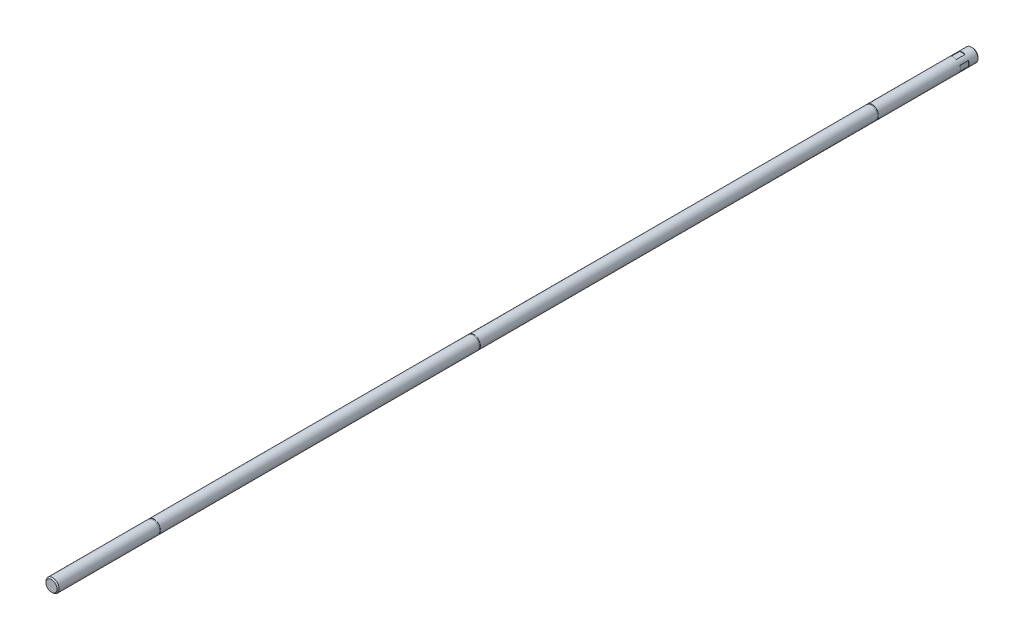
ISO-10303-21;
HEADER;
FILE_DESCRIPTION(('STEP AP214'),'2;1');
FILE_NAME('part.step','',(''),(''),'','','');
FILE_SCHEMA(('AUTOMOTIVE_DESIGN { 1 0 10303 214 1 1 1 1 }'));
ENDSEC;
DATA;
#1=APPLICATION_CONTEXT('core data for automotive mechanical design processes');
#2=APPLICATION_PROTOCOL_DEFINITION('international standard','automotive_design',2000,#1);
#3=PRODUCT_CONTEXT('',#1,'mechanical');
#4=PRODUCT('Part','Part','',(#3));
#5=PRODUCT_RELATED_PRODUCT_CATEGORY('part','',(#4));
#6=PRODUCT_DEFINITION_FORMATION('','',#4);
#7=PRODUCT_DEFINITION_CONTEXT('part definition',#1,'design');
#8=PRODUCT_DEFINITION('design','',#6,#7);
#9=PRODUCT_DEFINITION_SHAPE('','',#8);
#10=(LENGTH_UNIT() NAMED_UNIT(*) SI_UNIT(.MILLI.,.METRE.));
#11=(NAMED_UNIT(*) PLANE_ANGLE_UNIT() SI_UNIT($,.RADIAN.));
#12=(NAMED_UNIT(*) SI_UNIT($,.STERADIAN.) SOLID_ANGLE_UNIT());
#13=UNCERTAINTY_MEASURE_WITH_UNIT(LENGTH_MEASURE(1.E-05),#10,'distance_accuracy_value','');
#14=(GEOMETRIC_REPRESENTATION_CONTEXT(3) GLOBAL_UNCERTAINTY_ASSIGNED_CONTEXT((#13)) GLOBAL_UNIT_ASSIGNED_CONTEXT((#10,
#11,#12)) REPRESENTATION_CONTEXT('',''));
#15=CARTESIAN_POINT('',(0.,0.,0.));
#16=DIRECTION('',(0.,0.,1.));
#17=DIRECTION('',(1.,0.,0.));
#18=AXIS2_PLACEMENT_3D('',#15,#16,#17);
#19=CARTESIAN_POINT('',(0.,0.,835.));
#20=DIRECTION('',(0.,0.,-1.));
#21=DIRECTION('',(-1.,0.,0.));
#22=AXIS2_PLACEMENT_3D('',#19,#20,#21);
#23=CYLINDRICAL_SURFACE('',#22,6.);
#24=CARTESIAN_POINT('',(0.,0.,834.));
#25=DIRECTION('',(0.,0.,1.));
#26=DIRECTION('',(1.,0.,0.));
#27=AXIS2_PLACEMENT_3D('',#24,#25,#26);
#28=CIRCLE('',#27,6.);
#29=CARTESIAN_POINT('',(6.,0.,834.));
#30=VERTEX_POINT('',#29);
#31=EDGE_CURVE('E12',#30,#30,#28,.F.);
#32=ORIENTED_EDGE('',*,*,#31,.T.);
#33=EDGE_LOOP('',(#32));
#34=FACE_BOUND('',#33,.T.);
#35=CARTESIAN_POINT('',(0.,0.,743.2));
#36=DIRECTION('',(0.,0.,1.));
#37=DIRECTION('',(1.,0.,0.));
#38=AXIS2_PLACEMENT_3D('',#35,#36,#37);
#39=CIRCLE('',#38,6.);
#40=CARTESIAN_POINT('',(6.,0.,743.2));
#41=VERTEX_POINT('',#40);
#42=EDGE_CURVE('E974',#41,#41,#39,.T.);
#43=ORIENTED_EDGE('',*,*,#42,.T.);
#44=EDGE_LOOP('',(#43));
#45=FACE_BOUND('',#44,.T.);
#46=ADVANCED_FACE('F770',(#34,#45),#23,.T.);
#47=CARTESIAN_POINT('',(0.,0.,835.));
#48=DIRECTION('',(0.,0.,1.));
#49=DIRECTION('',(1.,0.,0.));
#50=AXIS2_PLACEMENT_3D('',#47,#48,#49);
#51=PLANE('',#50);
#52=CARTESIAN_POINT('',(0.,0.,835.));
#53=DIRECTION('',(0.,0.,1.));
#54=DIRECTION('',(1.,0.,0.));
#55=AXIS2_PLACEMENT_3D('',#52,#53,#54);
#56=CIRCLE('',#55,5.00000000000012);
#57=CARTESIAN_POINT('',(5.00000000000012,0.,835.));
#58=VERTEX_POINT('',#57);
#59=EDGE_CURVE('E779',#58,#58,#56,.T.);
#60=ORIENTED_EDGE('',*,*,#59,.T.);
#61=EDGE_LOOP('',(#60));
#62=FACE_BOUND('',#61,.T.);
#63=ADVANCED_FACE('F876',(#62),#51,.T.);
#64=CARTESIAN_POINT('',(6.,0.,743.2));
#65=DIRECTION('',(0.,0.,1.));
#66=DIRECTION('',(1.,0.,0.));
#67=AXIS2_PLACEMENT_3D('',#64,#65,#66);
#68=PLANE('',#67);
#69=ORIENTED_EDGE('',*,*,#42,.F.);
#70=EDGE_LOOP('',(#69));
#71=FACE_BOUND('',#70,.T.);
#72=CARTESIAN_POINT('',(0.,0.,743.2));
#73=DIRECTION('',(0.,0.,1.));
#74=DIRECTION('',(1.,0.,0.));
#75=AXIS2_PLACEMENT_3D('',#72,#73,#74);
#76=CIRCLE('',#75,5.74999999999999);
#77=CARTESIAN_POINT('',(5.74999999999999,0.,743.2));
#78=VERTEX_POINT('',#77);
#79=EDGE_CURVE('E1313',#78,#78,#76,.T.);
#80=ORIENTED_EDGE('',*,*,#79,.T.);
#81=EDGE_LOOP('',(#80));
#82=FACE_BOUND('',#81,.T.);
#83=ADVANCED_FACE('F893',(#71,#82),#68,.F.);
#84=CARTESIAN_POINT('',(0.,0.,835.));
#85=DIRECTION('',(0.,0.,1.));
#86=DIRECTION('',(1.,0.,0.));
#87=AXIS2_PLACEMENT_3D('',#84,#85,#86);
#88=CYLINDRICAL_SURFACE('',#87,5.74999999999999);
#89=ORIENTED_EDGE('',*,*,#79,.F.);
#90=EDGE_LOOP('',(#89));
#91=FACE_BOUND('',#90,.T.);
#92=CARTESIAN_POINT('',(0.,0.,742.1));
#93=DIRECTION('',(0.,0.,1.));
#94=DIRECTION('',(1.,0.,0.));
#95=AXIS2_PLACEMENT_3D('',#92,#93,#94);
#96=CIRCLE('',#95,5.74999999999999);
#97=CARTESIAN_POINT('',(5.74999999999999,0.,742.1));
#98=VERTEX_POINT('',#97);
#99=EDGE_CURVE('E1315',#98,#98,#96,.T.);
#100=ORIENTED_EDGE('',*,*,#99,.T.);
#101=EDGE_LOOP('',(#100));
#102=FACE_BOUND('',#101,.T.);
#103=ADVANCED_FACE('F923',(#91,#102),#88,.T.);
#104=CARTESIAN_POINT('',(6.,0.,742.1));
#105=DIRECTION('',(0.,0.,-1.));
#106=DIRECTION('',(-1.,0.,0.));
#107=AXIS2_PLACEMENT_3D('',#104,#105,#106);
#108=PLANE('',#107);
#109=ORIENTED_EDGE('',*,*,#99,.F.);
#110=EDGE_LOOP('',(#109));
#111=FACE_BOUND('',#110,.T.);
#112=CARTESIAN_POINT('',(0.,0.,742.1));
#113=DIRECTION('',(0.,0.,1.));
#114=DIRECTION('',(1.,0.,0.));
#115=AXIS2_PLACEMENT_3D('',#112,#113,#114);
#116=CIRCLE('',#115,6.);
#117=CARTESIAN_POINT('',(6.,0.,742.1));
#118=VERTEX_POINT('',#117);
#119=EDGE_CURVE('E929',#118,#118,#116,.T.);
#120=ORIENTED_EDGE('',*,*,#119,.T.);
#121=EDGE_LOOP('',(#120));
#122=FACE_BOUND('',#121,.T.);
#123=ADVANCED_FACE('F914',(#111,#122),#108,.F.);
#124=ORIENTED_EDGE('',*,*,#119,.F.);
#125=EDGE_LOOP('',(#124));
#126=FACE_BOUND('',#125,.T.);
#127=CARTESIAN_POINT('',(0.,0.,453.2));
#128=DIRECTION('',(0.,0.,1.));
#129=DIRECTION('',(1.,0.,0.));
#130=AXIS2_PLACEMENT_3D('',#127,#128,#129);
#131=CIRCLE('',#130,6.);
#132=CARTESIAN_POINT('',(6.,0.,453.2));
#133=VERTEX_POINT('',#132);
#134=EDGE_CURVE('E932',#133,#133,#131,.T.);
#135=ORIENTED_EDGE('',*,*,#134,.T.);
#136=EDGE_LOOP('',(#135));
#137=FACE_BOUND('',#136,.T.);
#138=ADVANCED_FACE('F901',(#126,#137),#23,.T.);
#139=CARTESIAN_POINT('',(6.,0.,453.2));
#140=DIRECTION('',(0.,0.,1.));
#141=DIRECTION('',(1.,0.,0.));
#142=AXIS2_PLACEMENT_3D('',#139,#140,#141);
#143=PLANE('',#142);
#144=ORIENTED_EDGE('',*,*,#134,.F.);
#145=EDGE_LOOP('',(#144));
#146=FACE_BOUND('',#145,.T.);
#147=CARTESIAN_POINT('',(0.,0.,453.2));
#148=DIRECTION('',(0.,0.,1.));
#149=DIRECTION('',(1.,0.,0.));
#150=AXIS2_PLACEMENT_3D('',#147,#148,#149);
#151=CIRCLE('',#150,5.74999999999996);
#152=CARTESIAN_POINT('',(5.74999999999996,0.,453.2));
#153=VERTEX_POINT('',#152);
#154=EDGE_CURVE('E935',#153,#153,#151,.T.);
#155=ORIENTED_EDGE('',*,*,#154,.T.);
#156=EDGE_LOOP('',(#155));
#157=FACE_BOUND('',#156,.T.);
#158=ADVANCED_FACE('F913',(#146,#157),#143,.F.);
#159=CARTESIAN_POINT('',(0.,0.,835.));
#160=DIRECTION('',(0.,0.,1.));
#161=DIRECTION('',(1.,0.,0.));
#162=AXIS2_PLACEMENT_3D('',#159,#160,#161);
#163=CYLINDRICAL_SURFACE('',#162,5.74999999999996);
#164=ORIENTED_EDGE('',*,*,#154,.F.);
#165=EDGE_LOOP('',(#164));
#166=FACE_BOUND('',#165,.T.);
#167=CARTESIAN_POINT('',(0.,0.,452.1));
#168=DIRECTION('',(0.,0.,1.));
#169=DIRECTION('',(1.,0.,0.));
#170=AXIS2_PLACEMENT_3D('',#167,#168,#169);
#171=CIRCLE('',#170,5.74999999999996);
#172=CARTESIAN_POINT('',(5.74999999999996,0.,452.1));
#173=VERTEX_POINT('',#172);
#174=EDGE_CURVE('E944',#173,#173,#171,.T.);
#175=ORIENTED_EDGE('',*,*,#174,.T.);
#176=EDGE_LOOP('',(#175));
#177=FACE_BOUND('',#176,.T.);
#178=ADVANCED_FACE('F920',(#166,#177),#163,.T.);
#179=CARTESIAN_POINT('',(6.,0.,452.1));
#180=DIRECTION('',(0.,0.,-1.));
#181=DIRECTION('',(-1.,0.,0.));
#182=AXIS2_PLACEMENT_3D('',#179,#180,#181);
#183=PLANE('',#182);
#184=ORIENTED_EDGE('',*,*,#174,.F.);
#185=EDGE_LOOP('',(#184));
#186=FACE_BOUND('',#185,.T.);
#187=CARTESIAN_POINT('',(0.,0.,452.1));
#188=DIRECTION('',(0.,0.,1.));
#189=DIRECTION('',(1.,0.,0.));
#190=AXIS2_PLACEMENT_3D('',#187,#188,#189);
#191=CIRCLE('',#190,6.);
#192=CARTESIAN_POINT('',(6.,0.,452.1));
#193=VERTEX_POINT('',#192);
#194=EDGE_CURVE('E1336',#193,#193,#191,.T.);
#195=ORIENTED_EDGE('',*,*,#194,.T.);
#196=EDGE_LOOP('',(#195));
#197=FACE_BOUND('',#196,.T.);
#198=ADVANCED_FACE('F899',(#186,#197),#183,.F.);
#199=CARTESIAN_POINT('',(0.,0.,92.1));
#200=DIRECTION('',(0.,0.,1.));
#201=DIRECTION('',(1.,0.,0.));
#202=AXIS2_PLACEMENT_3D('',#199,#200,#201);
#203=CIRCLE('',#202,6.);
#204=CARTESIAN_POINT('',(6.,0.,92.1));
#205=VERTEX_POINT('',#204);
#206=EDGE_CURVE('E1332',#205,#205,#203,.T.);
#207=ORIENTED_EDGE('',*,*,#206,.T.);
#208=EDGE_LOOP('',(#207));
#209=FACE_BOUND('',#208,.T.);
#210=ORIENTED_EDGE('',*,*,#194,.F.);
#211=EDGE_LOOP('',(#210));
#212=FACE_BOUND('',#211,.T.);
#213=ADVANCED_FACE('F889',(#209,#212),#23,.T.);
#214=CARTESIAN_POINT('',(6.,0.,92.1));
#215=DIRECTION('',(0.,0.,1.));
#216=DIRECTION('',(1.,0.,0.));
#217=AXIS2_PLACEMENT_3D('',#214,#215,#216);
#218=PLANE('',#217);
#219=ORIENTED_EDGE('',*,*,#206,.F.);
#220=EDGE_LOOP('',(#219));
#221=FACE_BOUND('',#220,.T.);
#222=CARTESIAN_POINT('',(0.,0.,92.1));
#223=DIRECTION('',(0.,0.,1.));
#224=DIRECTION('',(1.,0.,0.));
#225=AXIS2_PLACEMENT_3D('',#222,#223,#224);
#226=CIRCLE('',#225,5.74999999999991);
#227=CARTESIAN_POINT('',(5.74999999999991,0.,92.1));
#228=VERTEX_POINT('',#227);
#229=EDGE_CURVE('E1328',#228,#228,#226,.T.);
#230=ORIENTED_EDGE('',*,*,#229,.T.);
#231=EDGE_LOOP('',(#230));
#232=FACE_BOUND('',#231,.T.);
#233=ADVANCED_FACE('F898',(#221,#232),#218,.F.);
#234=CARTESIAN_POINT('',(0.,0.,835.));
#235=DIRECTION('',(0.,0.,1.));
#236=DIRECTION('',(1.,0.,0.));
#237=AXIS2_PLACEMENT_3D('',#234,#235,#236);
#238=CYLINDRICAL_SURFACE('',#237,5.74999999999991);
#239=ORIENTED_EDGE('',*,*,#229,.F.);
#240=EDGE_LOOP('',(#239));
#241=FACE_BOUND('',#240,.T.);
#242=CARTESIAN_POINT('',(0.,0.,91.));
#243=DIRECTION('',(0.,0.,1.));
#244=DIRECTION('',(1.,0.,0.));
#245=AXIS2_PLACEMENT_3D('',#242,#243,#244);
#246=CIRCLE('',#245,5.74999999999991);
#247=CARTESIAN_POINT('',(5.74999999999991,0.,91.));
#248=VERTEX_POINT('',#247);
#249=EDGE_CURVE('E941',#248,#248,#246,.T.);
#250=ORIENTED_EDGE('',*,*,#249,.T.);
#251=EDGE_LOOP('',(#250));
#252=FACE_BOUND('',#251,.T.);
#253=ADVANCED_FACE('F1120',(#241,#252),#238,.T.);
#254=CARTESIAN_POINT('',(6.,0.,91.));
#255=DIRECTION('',(0.,0.,-1.));
#256=DIRECTION('',(-1.,0.,0.));
#257=AXIS2_PLACEMENT_3D('',#254,#255,#256);
#258=PLANE('',#257);
#259=ORIENTED_EDGE('',*,*,#249,.F.);
#260=EDGE_LOOP('',(#259));
#261=FACE_BOUND('',#260,.T.);
#262=CARTESIAN_POINT('',(0.,0.,91.));
#263=DIRECTION('',(0.,0.,1.));
#264=DIRECTION('',(1.,0.,0.));
#265=AXIS2_PLACEMENT_3D('',#262,#263,#264);
#266=CIRCLE('',#265,6.);
#267=CARTESIAN_POINT('',(6.,0.,91.));
#268=VERTEX_POINT('',#267);
#269=EDGE_CURVE('E934',#268,#268,#266,.T.);
#270=ORIENTED_EDGE('',*,*,#269,.T.);
#271=EDGE_LOOP('',(#270));
#272=FACE_BOUND('',#271,.T.);
#273=ADVANCED_FACE('F1113',(#261,#272),#258,.F.);
#274=CARTESIAN_POINT('',(0.,0.,9.));
#275=DIRECTION('',(0.,0.,-1.));
#276=DIRECTION('',(0.,-1.,0.));
#277=AXIS2_PLACEMENT_3D('',#274,#275,#276);
#278=PLANE('',#277);
#279=DIRECTION('',(0.,1.,0.));
#280=VECTOR('',#279,1.);
#281=CARTESIAN_POINT('',(-5.49999999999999,-2.39791576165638,9.));
#282=LINE('',#281,#280);
#283=CARTESIAN_POINT('',(-5.49999999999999,-2.39791576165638,9.));
#284=VERTEX_POINT('',#283);
#285=CARTESIAN_POINT('',(-5.50000000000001,2.39791576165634,9.00000000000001));
#286=VERTEX_POINT('',#285);
#287=EDGE_CURVE('E844',#284,#286,#282,.T.);
#288=ORIENTED_EDGE('',*,*,#287,.T.);
#289=CARTESIAN_POINT('',(0.,0.,9.00000000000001));
#290=DIRECTION('',(0.,0.,-1.));
#291=DIRECTION('',(-1.,0.,0.));
#292=AXIS2_PLACEMENT_3D('',#289,#290,#291);
#293=CIRCLE('',#292,6.);
#294=EDGE_CURVE('E857',#284,#286,#293,.T.);
#295=ORIENTED_EDGE('',*,*,#294,.F.);
#296=EDGE_LOOP('',(#288,#295));
#297=FACE_BOUND('',#296,.T.);
#298=ADVANCED_FACE('F1119',(#297),#278,.F.);
#299=CARTESIAN_POINT('',(-5.49999999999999,-2.39791576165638,17.));
#300=DIRECTION('',(-1.,0.,0.));
#301=DIRECTION('',(0.,-1.,0.));
#302=AXIS2_PLACEMENT_3D('',#299,#300,#301);
#303=PLANE('',#302);
#304=ORIENTED_EDGE('',*,*,#287,.F.);
#305=DIRECTION('',(0.,0.,-1.));
#306=VECTOR('',#305,1.);
#307=CARTESIAN_POINT('',(-5.49999999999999,-2.39791576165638,17.));
#308=LINE('',#307,#306);
#309=CARTESIAN_POINT('',(-5.49999999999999,-2.39791576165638,17.));
#310=VERTEX_POINT('',#309);
#311=EDGE_CURVE('E847',#310,#284,#308,.T.);
#312=ORIENTED_EDGE('',*,*,#311,.F.);
#313=DIRECTION('',(0.,1.,0.));
#314=VECTOR('',#313,1.);
#315=CARTESIAN_POINT('',(-5.49999999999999,-2.39791576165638,17.));
#316=LINE('',#315,#314);
#317=CARTESIAN_POINT('',(-5.50000000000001,2.39791576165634,17.));
#318=VERTEX_POINT('',#317);
#319=EDGE_CURVE('E838',#310,#318,#316,.T.);
#320=ORIENTED_EDGE('',*,*,#319,.T.);
#321=DIRECTION('',(0.,0.,-1.));
#322=VECTOR('',#321,1.);
#323=CARTESIAN_POINT('',(-5.50000000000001,2.39791576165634,17.));
#324=LINE('',#323,#322);
#325=EDGE_CURVE('E786',#318,#286,#324,.T.);
#326=ORIENTED_EDGE('',*,*,#325,.T.);
#327=EDGE_LOOP('',(#304,#312,#320,#326));
#328=FACE_BOUND('',#327,.T.);
#329=ADVANCED_FACE('F848',(#328),#303,.T.);
#330=CARTESIAN_POINT('',(0.,0.,17.));
#331=DIRECTION('',(0.,0.,-1.));
#332=DIRECTION('',(0.,-1.,0.));
#333=AXIS2_PLACEMENT_3D('',#330,#331,#332);
#334=PLANE('',#333);
#335=CARTESIAN_POINT('',(0.,0.,17.));
#336=DIRECTION('',(0.,0.,-1.));
#337=DIRECTION('',(-1.,0.,0.));
#338=AXIS2_PLACEMENT_3D('',#335,#336,#337);
#339=CIRCLE('',#338,6.);
#340=EDGE_CURVE('E842',#310,#318,#339,.T.);
#341=ORIENTED_EDGE('',*,*,#340,.T.);
#342=ORIENTED_EDGE('',*,*,#319,.F.);
#343=EDGE_LOOP('',(#341,#342));
#344=FACE_BOUND('',#343,.T.);
#345=ADVANCED_FACE('F840',(#344),#334,.T.);
#346=CARTESIAN_POINT('',(0.,0.,9.));
#347=DIRECTION('',(0.,0.,-1.));
#348=DIRECTION('',(0.,1.,0.));
#349=AXIS2_PLACEMENT_3D('',#346,#347,#348);
#350=PLANE('',#349);
#351=DIRECTION('',(0.,-1.,0.));
#352=VECTOR('',#351,1.);
#353=CARTESIAN_POINT('',(5.49999999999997,2.39791576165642,9.));
#354=LINE('',#353,#352);
#355=CARTESIAN_POINT('',(5.49999999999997,2.39791576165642,9.));
#356=VERTEX_POINT('',#355);
#357=CARTESIAN_POINT('',(5.50000000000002,-2.39791576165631,9.00000000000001));
#358=VERTEX_POINT('',#357);
#359=EDGE_CURVE('E970',#356,#358,#354,.T.);
#360=ORIENTED_EDGE('',*,*,#359,.T.);
#361=CARTESIAN_POINT('',(0.,0.,9.00000000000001));
#362=DIRECTION('',(0.,0.,-1.));
#363=DIRECTION('',(-1.,0.,0.));
#364=AXIS2_PLACEMENT_3D('',#361,#362,#363);
#365=CIRCLE('',#364,6.);
#366=EDGE_CURVE('E1001',#356,#358,#365,.T.);
#367=ORIENTED_EDGE('',*,*,#366,.F.);
#368=EDGE_LOOP('',(#360,#367));
#369=FACE_BOUND('',#368,.T.);
#370=ADVANCED_FACE('F1038',(#369),#350,.F.);
#371=CARTESIAN_POINT('',(5.49999999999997,2.39791576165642,17.));
#372=DIRECTION('',(1.,0.,0.));
#373=DIRECTION('',(0.,1.,0.));
#374=AXIS2_PLACEMENT_3D('',#371,#372,#373);
#375=PLANE('',#374);
#376=ORIENTED_EDGE('',*,*,#359,.F.);
#377=DIRECTION('',(0.,0.,-1.));
#378=VECTOR('',#377,1.);
#379=CARTESIAN_POINT('',(5.49999999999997,2.39791576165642,17.));
#380=LINE('',#379,#378);
#381=CARTESIAN_POINT('',(5.49999999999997,2.39791576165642,17.));
#382=VERTEX_POINT('',#381);
#383=EDGE_CURVE('E959',#382,#356,#380,.T.);
#384=ORIENTED_EDGE('',*,*,#383,.F.);
#385=DIRECTION('',(0.,-1.,0.));
#386=VECTOR('',#385,1.);
#387=CARTESIAN_POINT('',(5.49999999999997,2.39791576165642,17.));
#388=LINE('',#387,#386);
#389=CARTESIAN_POINT('',(5.50000000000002,-2.39791576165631,17.));
#390=VERTEX_POINT('',#389);
#391=EDGE_CURVE('E965',#382,#390,#388,.T.);
#392=ORIENTED_EDGE('',*,*,#391,.T.);
#393=DIRECTION('',(0.,0.,-1.));
#394=VECTOR('',#393,1.);
#395=CARTESIAN_POINT('',(5.50000000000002,-2.39791576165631,17.));
#396=LINE('',#395,#394);
#397=EDGE_CURVE('E969',#390,#358,#396,.T.);
#398=ORIENTED_EDGE('',*,*,#397,.T.);
#399=EDGE_LOOP('',(#376,#384,#392,#398));
#400=FACE_BOUND('',#399,.T.);
#401=ADVANCED_FACE('F1036',(#400),#375,.T.);
#402=CARTESIAN_POINT('',(0.,0.,17.));
#403=DIRECTION('',(0.,0.,-1.));
#404=DIRECTION('',(0.,1.,0.));
#405=AXIS2_PLACEMENT_3D('',#402,#403,#404);
#406=PLANE('',#405);
#407=CARTESIAN_POINT('',(0.,0.,17.));
#408=DIRECTION('',(0.,0.,-1.));
#409=DIRECTION('',(-1.,0.,0.));
#410=AXIS2_PLACEMENT_3D('',#407,#408,#409);
#411=CIRCLE('',#410,6.);
#412=EDGE_CURVE('E1005',#382,#390,#411,.T.);
#413=ORIENTED_EDGE('',*,*,#412,.T.);
#414=ORIENTED_EDGE('',*,*,#391,.F.);
#415=EDGE_LOOP('',(#413,#414));
#416=FACE_BOUND('',#415,.T.);
#417=ADVANCED_FACE('F1032',(#416),#406,.T.);
#418=CARTESIAN_POINT('',(0.,0.,0.));
#419=DIRECTION('',(0.,0.,1.));
#420=DIRECTION('',(1.,0.,0.));
#421=AXIS2_PLACEMENT_3D('',#418,#419,#420);
#422=PLANE('',#421);
#423=CARTESIAN_POINT('',(0.,0.,0.));
#424=DIRECTION('',(0.,0.,1.));
#425=DIRECTION('',(1.,0.,0.));
#426=AXIS2_PLACEMENT_3D('',#423,#424,#425);
#427=CIRCLE('',#426,5.00000000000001);
#428=CARTESIAN_POINT('',(5.00000000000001,0.,0.));
#429=VERTEX_POINT('',#428);
#430=EDGE_CURVE('E863',#429,#429,#427,.F.);
#431=ORIENTED_EDGE('',*,*,#430,.T.);
#432=EDGE_LOOP('',(#431));
#433=FACE_BOUND('',#432,.T.);
#434=ADVANCED_FACE('F1035',(#433),#422,.F.);
#435=CARTESIAN_POINT('',(0.,0.,9.));
#436=DIRECTION('',(0.,0.,-1.));
#437=DIRECTION('',(-1.,0.,0.));
#438=AXIS2_PLACEMENT_3D('',#435,#436,#437);
#439=PLANE('',#438);
#440=DIRECTION('',(1.,0.,0.));
#441=VECTOR('',#440,1.);
#442=CARTESIAN_POINT('',(-2.39791576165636,5.5,9.));
#443=LINE('',#442,#441);
#444=CARTESIAN_POINT('',(-2.39791576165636,5.5,9.));
#445=VERTEX_POINT('',#444);
#446=CARTESIAN_POINT('',(2.39791576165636,5.5,9.00000000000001));
#447=VERTEX_POINT('',#446);
#448=EDGE_CURVE('E852',#445,#447,#443,.T.);
#449=ORIENTED_EDGE('',*,*,#448,.T.);
#450=CARTESIAN_POINT('',(0.,0.,9.00000000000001));
#451=DIRECTION('',(0.,0.,-1.));
#452=DIRECTION('',(-1.,0.,0.));
#453=AXIS2_PLACEMENT_3D('',#450,#451,#452);
#454=CIRCLE('',#453,6.);
#455=EDGE_CURVE('E994',#445,#447,#454,.T.);
#456=ORIENTED_EDGE('',*,*,#455,.F.);
#457=EDGE_LOOP('',(#449,#456));
#458=FACE_BOUND('',#457,.T.);
#459=ADVANCED_FACE('F1045',(#458),#439,.F.);
#460=CARTESIAN_POINT('',(-2.39791576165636,5.5,17.));
#461=DIRECTION('',(0.,1.,0.));
#462=DIRECTION('',(0.,0.,1.));
#463=AXIS2_PLACEMENT_3D('',#460,#461,#462);
#464=PLANE('',#463);
#465=ORIENTED_EDGE('',*,*,#448,.F.);
#466=DIRECTION('',(0.,0.,-1.));
#467=VECTOR('',#466,1.);
#468=CARTESIAN_POINT('',(-2.39791576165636,5.5,17.));
#469=LINE('',#468,#467);
#470=CARTESIAN_POINT('',(-2.39791576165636,5.5,17.));
#471=VERTEX_POINT('',#470);
#472=EDGE_CURVE('E990',#471,#445,#469,.T.);
#473=ORIENTED_EDGE('',*,*,#472,.F.);
#474=DIRECTION('',(1.,0.,0.));
#475=VECTOR('',#474,1.);
#476=CARTESIAN_POINT('',(-2.39791576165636,5.5,17.));
#477=LINE('',#476,#475);
#478=CARTESIAN_POINT('',(2.39791576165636,5.5,17.));
#479=VERTEX_POINT('',#478);
#480=EDGE_CURVE('E980',#471,#479,#477,.T.);
#481=ORIENTED_EDGE('',*,*,#480,.T.);
#482=DIRECTION('',(0.,0.,-1.));
#483=VECTOR('',#482,1.);
#484=CARTESIAN_POINT('',(2.39791576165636,5.5,17.));
#485=LINE('',#484,#483);
#486=EDGE_CURVE('E984',#479,#447,#485,.T.);
#487=ORIENTED_EDGE('',*,*,#486,.T.);
#488=EDGE_LOOP('',(#465,#473,#481,#487));
#489=FACE_BOUND('',#488,.T.);
#490=ADVANCED_FACE('F1027',(#489),#464,.T.);
#491=CARTESIAN_POINT('',(0.,0.,17.));
#492=DIRECTION('',(0.,0.,-1.));
#493=DIRECTION('',(-1.,0.,0.));
#494=AXIS2_PLACEMENT_3D('',#491,#492,#493);
#495=PLANE('',#494);
#496=CARTESIAN_POINT('',(0.,0.,17.));
#497=DIRECTION('',(0.,0.,-1.));
#498=DIRECTION('',(-1.,0.,0.));
#499=AXIS2_PLACEMENT_3D('',#496,#497,#498);
#500=CIRCLE('',#499,6.);
#501=EDGE_CURVE('E998',#471,#479,#500,.T.);
#502=ORIENTED_EDGE('',*,*,#501,.T.);
#503=ORIENTED_EDGE('',*,*,#480,.F.);
#504=EDGE_LOOP('',(#502,#503));
#505=FACE_BOUND('',#504,.T.);
#506=ADVANCED_FACE('F1020',(#505),#495,.T.);
#507=CARTESIAN_POINT('',(0.,0.,9.));
#508=DIRECTION('',(0.,0.,-1.));
#509=DIRECTION('',(1.,0.,0.));
#510=AXIS2_PLACEMENT_3D('',#507,#508,#509);
#511=PLANE('',#510);
#512=DIRECTION('',(-1.,0.,0.));
#513=VECTOR('',#512,1.);
#514=CARTESIAN_POINT('',(2.39791576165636,-5.5,9.));
#515=LINE('',#514,#513);
#516=CARTESIAN_POINT('',(2.39791576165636,-5.5,9.));
#517=VERTEX_POINT('',#516);
#518=CARTESIAN_POINT('',(-2.39791576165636,-5.5,9.00000000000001));
#519=VERTEX_POINT('',#518);
#520=EDGE_CURVE('E956',#517,#519,#515,.T.);
#521=ORIENTED_EDGE('',*,*,#520,.T.);
#522=CARTESIAN_POINT('',(0.,0.,9.00000000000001));
#523=DIRECTION('',(0.,0.,-1.));
#524=DIRECTION('',(-1.,0.,0.));
#525=AXIS2_PLACEMENT_3D('',#522,#523,#524);
#526=CIRCLE('',#525,6.);
#527=EDGE_CURVE('E1008',#517,#519,#526,.T.);
#528=ORIENTED_EDGE('',*,*,#527,.F.);
#529=EDGE_LOOP('',(#521,#528));
#530=FACE_BOUND('',#529,.T.);
#531=ADVANCED_FACE('F1018',(#530),#511,.F.);
#532=CARTESIAN_POINT('',(2.39791576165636,-5.5,17.));
#533=DIRECTION('',(0.,-1.,0.));
#534=DIRECTION('',(0.,0.,-1.));
#535=AXIS2_PLACEMENT_3D('',#532,#533,#534);
#536=PLANE('',#535);
#537=ORIENTED_EDGE('',*,*,#520,.F.);
#538=DIRECTION('',(0.,0.,-1.));
#539=VECTOR('',#538,1.);
#540=CARTESIAN_POINT('',(2.39791576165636,-5.5,17.));
#541=LINE('',#540,#539);
#542=CARTESIAN_POINT('',(2.39791576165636,-5.5,17.));
#543=VERTEX_POINT('',#542);
#544=EDGE_CURVE('E950',#543,#517,#541,.T.);
#545=ORIENTED_EDGE('',*,*,#544,.F.);
#546=DIRECTION('',(-1.,0.,0.));
#547=VECTOR('',#546,1.);
#548=CARTESIAN_POINT('',(2.39791576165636,-5.5,17.));
#549=LINE('',#548,#547);
#550=CARTESIAN_POINT('',(-2.39791576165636,-5.5,17.));
#551=VERTEX_POINT('',#550);
#552=EDGE_CURVE('E953',#543,#551,#549,.T.);
#553=ORIENTED_EDGE('',*,*,#552,.T.);
#554=DIRECTION('',(0.,0.,-1.));
#555=VECTOR('',#554,1.);
#556=CARTESIAN_POINT('',(-2.39791576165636,-5.5,17.));
#557=LINE('',#556,#555);
#558=EDGE_CURVE('E794',#551,#519,#557,.T.);
#559=ORIENTED_EDGE('',*,*,#558,.T.);
#560=EDGE_LOOP('',(#537,#545,#553,#559));
#561=FACE_BOUND('',#560,.T.);
#562=ADVANCED_FACE('F908',(#561),#536,.T.);
#563=CARTESIAN_POINT('',(0.,0.,17.));
#564=DIRECTION('',(0.,0.,-1.));
#565=DIRECTION('',(1.,0.,0.));
#566=AXIS2_PLACEMENT_3D('',#563,#564,#565);
#567=PLANE('',#566);
#568=CARTESIAN_POINT('',(0.,0.,17.));
#569=DIRECTION('',(0.,0.,-1.));
#570=DIRECTION('',(-1.,0.,0.));
#571=AXIS2_PLACEMENT_3D('',#568,#569,#570);
#572=CIRCLE('',#571,6.);
#573=EDGE_CURVE('E865',#543,#551,#572,.T.);
#574=ORIENTED_EDGE('',*,*,#573,.T.);
#575=ORIENTED_EDGE('',*,*,#552,.F.);
#576=EDGE_LOOP('',(#574,#575));
#577=FACE_BOUND('',#576,.T.);
#578=ADVANCED_FACE('F903',(#577),#567,.T.);
#579=CARTESIAN_POINT('',(0.,0.,1.));
#580=DIRECTION('',(0.,0.,1.));
#581=DIRECTION('',(1.,0.,0.));
#582=AXIS2_PLACEMENT_3D('',#579,#580,#581);
#583=CIRCLE('',#582,6.);
#584=CARTESIAN_POINT('',(6.,0.,1.));
#585=VERTEX_POINT('',#584);
#586=EDGE_CURVE('E856',#585,#585,#583,.T.);
#587=ORIENTED_EDGE('',*,*,#586,.T.);
#588=EDGE_LOOP('',(#587));
#589=FACE_BOUND('',#588,.T.);
#590=ORIENTED_EDGE('',*,*,#269,.F.);
#591=EDGE_LOOP('',(#590));
#592=FACE_BOUND('',#591,.T.);
#593=ORIENTED_EDGE('',*,*,#573,.F.);
#594=ORIENTED_EDGE('',*,*,#544,.T.);
#595=ORIENTED_EDGE('',*,*,#527,.T.);
#596=ORIENTED_EDGE('',*,*,#558,.F.);
#597=EDGE_LOOP('',(#593,#594,#595,#596));
#598=FACE_BOUND('',#597,.T.);
#599=ORIENTED_EDGE('',*,*,#501,.F.);
#600=ORIENTED_EDGE('',*,*,#472,.T.);
#601=ORIENTED_EDGE('',*,*,#455,.T.);
#602=ORIENTED_EDGE('',*,*,#486,.F.);
#603=EDGE_LOOP('',(#599,#600,#601,#602));
#604=FACE_BOUND('',#603,.T.);
#605=ORIENTED_EDGE('',*,*,#412,.F.);
#606=ORIENTED_EDGE('',*,*,#383,.T.);
#607=ORIENTED_EDGE('',*,*,#366,.T.);
#608=ORIENTED_EDGE('',*,*,#397,.F.);
#609=EDGE_LOOP('',(#605,#606,#607,#608));
#610=FACE_BOUND('',#609,.T.);
#611=ORIENTED_EDGE('',*,*,#340,.F.);
#612=ORIENTED_EDGE('',*,*,#311,.T.);
#613=ORIENTED_EDGE('',*,*,#294,.T.);
#614=ORIENTED_EDGE('',*,*,#325,.F.);
#615=EDGE_LOOP('',(#611,#612,#613,#614));
#616=FACE_BOUND('',#615,.T.);
#617=ADVANCED_FACE('F854',(#589,#592,#598,#604,#610,#616),#23,.T.);
#618=CARTESIAN_POINT('',(0.,0.,1.));
#619=DIRECTION('',(0.,0.,1.));
#620=DIRECTION('',(1.,0.,0.));
#621=AXIS2_PLACEMENT_3D('',#618,#619,#620);
#622=CONICAL_SURFACE('',#621,6.,0.785398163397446);
#623=ORIENTED_EDGE('',*,*,#430,.F.);
#624=EDGE_LOOP('',(#623));
#625=FACE_BOUND('',#624,.T.);
#626=ORIENTED_EDGE('',*,*,#586,.F.);
#627=EDGE_LOOP('',(#626));
#628=FACE_BOUND('',#627,.T.);
#629=ADVANCED_FACE('F879',(#625,#628),#622,.T.);
#630=CARTESIAN_POINT('',(0.,0.,835.));
#631=DIRECTION('',(0.,0.,-1.));
#632=DIRECTION('',(-1.,0.,0.));
#633=AXIS2_PLACEMENT_3D('',#630,#631,#632);
#634=CONICAL_SURFACE('',#633,5.00000000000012,0.785398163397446);
#635=ORIENTED_EDGE('',*,*,#31,.F.);
#636=EDGE_LOOP('',(#635));
#637=FACE_BOUND('',#636,.T.);
#638=ORIENTED_EDGE('',*,*,#59,.F.);
#639=EDGE_LOOP('',(#638));
#640=FACE_BOUND('',#639,.T.);
#641=ADVANCED_FACE('F772',(#637,#640),#634,.T.);
#642=CLOSED_SHELL('',(#46,#63,#83,#103,#123,#138,#158,#178,#198,#213,#233,#253,#273,#298,#329,
#345,#370,#401,#417,#434,#459,#490,#506,#531,#562,#578,#617,#629,#641));
#643=MANIFOLD_SOLID_BREP('B2',#642);
#644=ADVANCED_BREP_SHAPE_REPRESENTATION('',(#18,#643),#14);
#645=SHAPE_DEFINITION_REPRESENTATION(#9,#644);
ENDSEC;
END-ISO-10303-21;
